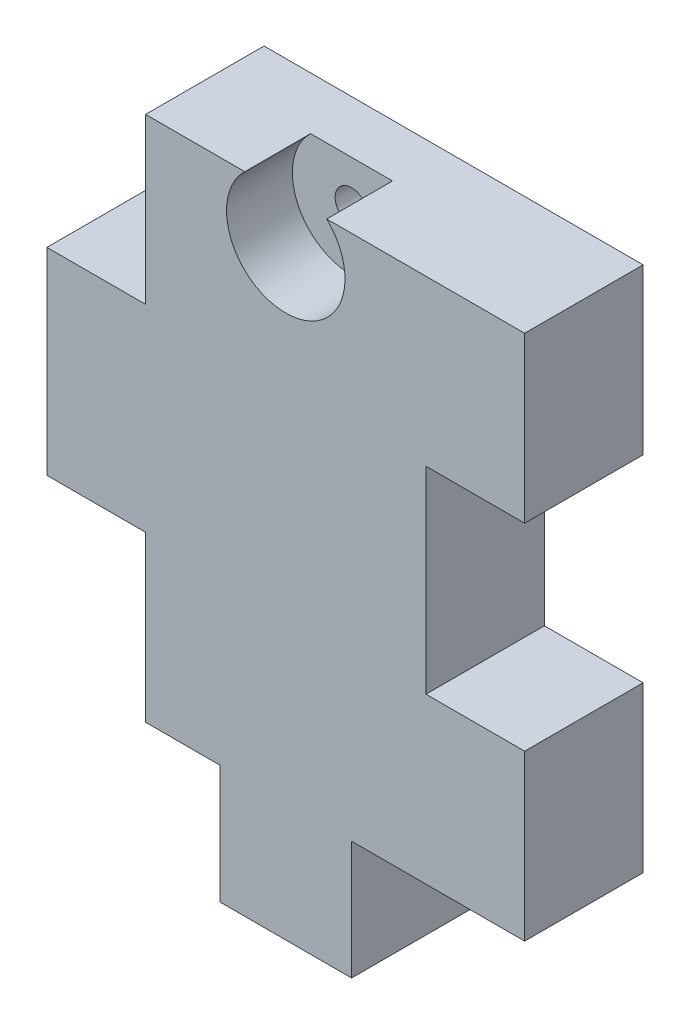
ISO-10303-21;
HEADER;
FILE_DESCRIPTION(('STEP AP214'),'2;1');
FILE_NAME('part.step','',(''),(''),'','','');
FILE_SCHEMA(('AUTOMOTIVE_DESIGN { 1 0 10303 214 1 1 1 1 }'));
ENDSEC;
DATA;
#1=APPLICATION_CONTEXT('core data for automotive mechanical design processes');
#2=APPLICATION_PROTOCOL_DEFINITION('international standard','automotive_design',2000,#1);
#3=PRODUCT_CONTEXT('',#1,'mechanical');
#4=PRODUCT('Part','Part','',(#3));
#5=PRODUCT_RELATED_PRODUCT_CATEGORY('part','',(#4));
#6=PRODUCT_DEFINITION_FORMATION('','',#4);
#7=PRODUCT_DEFINITION_CONTEXT('part definition',#1,'design');
#8=PRODUCT_DEFINITION('design','',#6,#7);
#9=PRODUCT_DEFINITION_SHAPE('','',#8);
#10=(LENGTH_UNIT() NAMED_UNIT(*) SI_UNIT(.MILLI.,.METRE.));
#11=(NAMED_UNIT(*) PLANE_ANGLE_UNIT() SI_UNIT($,.RADIAN.));
#12=(NAMED_UNIT(*) SI_UNIT($,.STERADIAN.) SOLID_ANGLE_UNIT());
#13=UNCERTAINTY_MEASURE_WITH_UNIT(LENGTH_MEASURE(1.E-05),#10,'distance_accuracy_value','');
#14=(GEOMETRIC_REPRESENTATION_CONTEXT(3) GLOBAL_UNCERTAINTY_ASSIGNED_CONTEXT((#13)) GLOBAL_UNIT_ASSIGNED_CONTEXT((#10,
#11,#12)) REPRESENTATION_CONTEXT('',''));
#15=CARTESIAN_POINT('',(0.,0.,0.));
#16=DIRECTION('',(0.,0.,1.));
#17=DIRECTION('',(1.,0.,0.));
#18=AXIS2_PLACEMENT_3D('',#15,#16,#17);
#19=CARTESIAN_POINT('',(21.3,-40.,18.));
#20=DIRECTION('',(0.,1.,0.));
#21=DIRECTION('',(0.,0.,1.));
#22=AXIS2_PLACEMENT_3D('',#19,#20,#21);
#23=PLANE('',#22);
#24=DIRECTION('',(1.,0.,0.));
#25=VECTOR('',#24,1.);
#26=CARTESIAN_POINT('',(21.3,-40.,0.));
#27=LINE('',#26,#25);
#28=CARTESIAN_POINT('',(-21.3,-40.,0.));
#29=VERTEX_POINT('',#28);
#30=CARTESIAN_POINT('',(-10.,-40.,0.));
#31=VERTEX_POINT('',#30);
#32=EDGE_CURVE('E246',#29,#31,#27,.T.);
#33=ORIENTED_EDGE('',*,*,#32,.T.);
#34=DIRECTION('',(0.,0.,1.));
#35=VECTOR('',#34,1.);
#36=CARTESIAN_POINT('',(-10.,-40.,18.));
#37=LINE('',#36,#35);
#38=CARTESIAN_POINT('',(-10.,-40.,18.));
#39=VERTEX_POINT('',#38);
#40=EDGE_CURVE('E167',#31,#39,#37,.T.);
#41=ORIENTED_EDGE('',*,*,#40,.T.);
#42=DIRECTION('',(1.,0.,0.));
#43=VECTOR('',#42,1.);
#44=CARTESIAN_POINT('',(-21.3,-40.,18.));
#45=LINE('',#44,#43);
#46=CARTESIAN_POINT('',(-21.3,-40.,18.));
#47=VERTEX_POINT('',#46);
#48=EDGE_CURVE('E219',#47,#39,#45,.T.);
#49=ORIENTED_EDGE('',*,*,#48,.F.);
#50=DIRECTION('',(0.,0.,-1.));
#51=VECTOR('',#50,1.);
#52=CARTESIAN_POINT('',(-21.3,-40.,18.));
#53=LINE('',#52,#51);
#54=EDGE_CURVE('E276',#47,#29,#53,.T.);
#55=ORIENTED_EDGE('',*,*,#54,.T.);
#56=EDGE_LOOP('',(#33,#41,#49,#55));
#57=FACE_BOUND('',#56,.T.);
#58=ADVANCED_FACE('F34',(#57),#23,.F.);
#59=CARTESIAN_POINT('',(-21.3,40.,18.));
#60=DIRECTION('',(0.,-1.,0.));
#61=DIRECTION('',(0.,0.,-1.));
#62=AXIS2_PLACEMENT_3D('',#59,#60,#61);
#63=PLANE('',#62);
#64=DIRECTION('',(-1.,0.,0.));
#65=VECTOR('',#64,1.);
#66=CARTESIAN_POINT('',(-21.3,40.,8.));
#67=LINE('',#66,#65);
#68=CARTESIAN_POINT('',(6.22494979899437,40.,8.));
#69=VERTEX_POINT('',#68);
#70=CARTESIAN_POINT('',(-6.22494979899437,40.,8.));
#71=VERTEX_POINT('',#70);
#72=EDGE_CURVE('E11',#69,#71,#67,.T.);
#73=ORIENTED_EDGE('',*,*,#72,.F.);
#74=DIRECTION('',(0.,0.,1.));
#75=VECTOR('',#74,1.);
#76=CARTESIAN_POINT('',(6.22494979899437,40.,8.));
#77=LINE('',#76,#75);
#78=CARTESIAN_POINT('',(6.22494979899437,40.,18.));
#79=VERTEX_POINT('',#78);
#80=EDGE_CURVE('E200',#69,#79,#77,.T.);
#81=ORIENTED_EDGE('',*,*,#80,.T.);
#82=DIRECTION('',(-1.,0.,0.));
#83=VECTOR('',#82,1.);
#84=CARTESIAN_POINT('',(21.3,40.,18.));
#85=LINE('',#84,#83);
#86=CARTESIAN_POINT('',(36.3,40.,18.));
#87=VERTEX_POINT('',#86);
#88=EDGE_CURVE('E204',#87,#79,#85,.T.);
#89=ORIENTED_EDGE('',*,*,#88,.F.);
#90=DIRECTION('',(0.,0.,-1.));
#91=VECTOR('',#90,1.);
#92=CARTESIAN_POINT('',(36.3,40.,18.));
#93=LINE('',#92,#91);
#94=CARTESIAN_POINT('',(36.3,40.,0.));
#95=VERTEX_POINT('',#94);
#96=EDGE_CURVE('E232',#87,#95,#93,.T.);
#97=ORIENTED_EDGE('',*,*,#96,.T.);
#98=DIRECTION('',(-1.,0.,0.));
#99=VECTOR('',#98,1.);
#100=CARTESIAN_POINT('',(-21.3,40.,0.));
#101=LINE('',#100,#99);
#102=CARTESIAN_POINT('',(-21.3,40.,0.));
#103=VERTEX_POINT('',#102);
#104=EDGE_CURVE('E203',#95,#103,#101,.T.);
#105=ORIENTED_EDGE('',*,*,#104,.T.);
#106=DIRECTION('',(0.,0.,-1.));
#107=VECTOR('',#106,1.);
#108=CARTESIAN_POINT('',(-21.3,40.,18.));
#109=LINE('',#108,#107);
#110=CARTESIAN_POINT('',(-21.3,40.,18.));
#111=VERTEX_POINT('',#110);
#112=EDGE_CURVE('E291',#111,#103,#109,.T.);
#113=ORIENTED_EDGE('',*,*,#112,.F.);
#114=CARTESIAN_POINT('',(-6.22494979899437,40.,18.));
#115=VERTEX_POINT('',#114);
#116=EDGE_CURVE('E208',#115,#111,#85,.T.);
#117=ORIENTED_EDGE('',*,*,#116,.F.);
#118=DIRECTION('',(0.,0.,1.));
#119=VECTOR('',#118,1.);
#120=CARTESIAN_POINT('',(-6.22494979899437,40.,8.));
#121=LINE('',#120,#119);
#122=EDGE_CURVE('E58',#115,#71,#121,.F.);
#123=ORIENTED_EDGE('',*,*,#122,.T.);
#124=EDGE_LOOP('',(#73,#81,#89,#97,#105,#113,#117,#123));
#125=FACE_BOUND('',#124,.T.);
#126=ADVANCED_FACE('F36',(#125),#63,.F.);
#127=CARTESIAN_POINT('',(-21.3,40.,18.));
#128=DIRECTION('',(1.,0.,0.));
#129=DIRECTION('',(0.,1.,0.));
#130=AXIS2_PLACEMENT_3D('',#127,#128,#129);
#131=PLANE('',#130);
#132=DIRECTION('',(0.,-1.,0.));
#133=VECTOR('',#132,1.);
#134=CARTESIAN_POINT('',(-21.3,40.,0.));
#135=LINE('',#134,#133);
#136=CARTESIAN_POINT('',(-21.3,15.,0.));
#137=VERTEX_POINT('',#136);
#138=EDGE_CURVE('E234',#103,#137,#135,.T.);
#139=ORIENTED_EDGE('',*,*,#138,.T.);
#140=DIRECTION('',(0.,0.,-1.));
#141=VECTOR('',#140,1.);
#142=CARTESIAN_POINT('',(-21.3,15.,18.));
#143=LINE('',#142,#141);
#144=CARTESIAN_POINT('',(-21.3,15.,18.));
#145=VERTEX_POINT('',#144);
#146=EDGE_CURVE('E288',#145,#137,#143,.T.);
#147=ORIENTED_EDGE('',*,*,#146,.F.);
#148=DIRECTION('',(0.,-1.,0.));
#149=VECTOR('',#148,1.);
#150=CARTESIAN_POINT('',(-21.3,40.,18.));
#151=LINE('',#150,#149);
#152=EDGE_CURVE('E207',#111,#145,#151,.T.);
#153=ORIENTED_EDGE('',*,*,#152,.F.);
#154=ORIENTED_EDGE('',*,*,#112,.T.);
#155=EDGE_LOOP('',(#139,#147,#153,#154));
#156=FACE_BOUND('',#155,.T.);
#157=ADVANCED_FACE('F304',(#156),#131,.F.);
#158=CARTESIAN_POINT('',(-36.3,15.,18.));
#159=DIRECTION('',(0.,-1.,0.));
#160=DIRECTION('',(0.,0.,-1.));
#161=AXIS2_PLACEMENT_3D('',#158,#159,#160);
#162=PLANE('',#161);
#163=DIRECTION('',(-1.,0.,0.));
#164=VECTOR('',#163,1.);
#165=CARTESIAN_POINT('',(-36.3,15.,0.));
#166=LINE('',#165,#164);
#167=CARTESIAN_POINT('',(-36.3,15.,0.));
#168=VERTEX_POINT('',#167);
#169=EDGE_CURVE('E236',#137,#168,#166,.T.);
#170=ORIENTED_EDGE('',*,*,#169,.T.);
#171=DIRECTION('',(0.,0.,-1.));
#172=VECTOR('',#171,1.);
#173=CARTESIAN_POINT('',(-36.3,15.,18.));
#174=LINE('',#173,#172);
#175=CARTESIAN_POINT('',(-36.3,15.,18.));
#176=VERTEX_POINT('',#175);
#177=EDGE_CURVE('E285',#176,#168,#174,.T.);
#178=ORIENTED_EDGE('',*,*,#177,.F.);
#179=DIRECTION('',(-1.,0.,0.));
#180=VECTOR('',#179,1.);
#181=CARTESIAN_POINT('',(-36.3,15.,18.));
#182=LINE('',#181,#180);
#183=EDGE_CURVE('E210',#145,#176,#182,.T.);
#184=ORIENTED_EDGE('',*,*,#183,.F.);
#185=ORIENTED_EDGE('',*,*,#146,.T.);
#186=EDGE_LOOP('',(#170,#178,#184,#185));
#187=FACE_BOUND('',#186,.T.);
#188=ADVANCED_FACE('F310',(#187),#162,.F.);
#189=CARTESIAN_POINT('',(-36.3,15.,18.));
#190=DIRECTION('',(1.,0.,0.));
#191=DIRECTION('',(0.,0.,-1.));
#192=AXIS2_PLACEMENT_3D('',#189,#190,#191);
#193=PLANE('',#192);
#194=DIRECTION('',(0.,-1.,0.));
#195=VECTOR('',#194,1.);
#196=CARTESIAN_POINT('',(-36.3,15.,0.));
#197=LINE('',#196,#195);
#198=CARTESIAN_POINT('',(-36.3,-15.,0.));
#199=VERTEX_POINT('',#198);
#200=EDGE_CURVE('E238',#168,#199,#197,.T.);
#201=ORIENTED_EDGE('',*,*,#200,.T.);
#202=DIRECTION('',(0.,0.,-1.));
#203=VECTOR('',#202,1.);
#204=CARTESIAN_POINT('',(-36.3,-15.,18.));
#205=LINE('',#204,#203);
#206=CARTESIAN_POINT('',(-36.3,-15.,18.));
#207=VERTEX_POINT('',#206);
#208=EDGE_CURVE('E282',#207,#199,#205,.T.);
#209=ORIENTED_EDGE('',*,*,#208,.F.);
#210=DIRECTION('',(0.,-1.,0.));
#211=VECTOR('',#210,1.);
#212=CARTESIAN_POINT('',(-36.3,15.,18.));
#213=LINE('',#212,#211);
#214=EDGE_CURVE('E212',#176,#207,#213,.T.);
#215=ORIENTED_EDGE('',*,*,#214,.F.);
#216=ORIENTED_EDGE('',*,*,#177,.T.);
#217=EDGE_LOOP('',(#201,#209,#215,#216));
#218=FACE_BOUND('',#217,.T.);
#219=ADVANCED_FACE('F314',(#218),#193,.F.);
#220=CARTESIAN_POINT('',(-21.3,-15.,18.));
#221=DIRECTION('',(0.,1.,0.));
#222=DIRECTION('',(0.,0.,1.));
#223=AXIS2_PLACEMENT_3D('',#220,#221,#222);
#224=PLANE('',#223);
#225=DIRECTION('',(1.,0.,0.));
#226=VECTOR('',#225,1.);
#227=CARTESIAN_POINT('',(-21.3,-15.,0.));
#228=LINE('',#227,#226);
#229=CARTESIAN_POINT('',(-21.3,-15.,0.));
#230=VERTEX_POINT('',#229);
#231=EDGE_CURVE('E240',#199,#230,#228,.T.);
#232=ORIENTED_EDGE('',*,*,#231,.T.);
#233=DIRECTION('',(0.,0.,-1.));
#234=VECTOR('',#233,1.);
#235=CARTESIAN_POINT('',(-21.3,-15.,18.));
#236=LINE('',#235,#234);
#237=CARTESIAN_POINT('',(-21.3,-15.,18.));
#238=VERTEX_POINT('',#237);
#239=EDGE_CURVE('E279',#238,#230,#236,.T.);
#240=ORIENTED_EDGE('',*,*,#239,.F.);
#241=DIRECTION('',(1.,0.,0.));
#242=VECTOR('',#241,1.);
#243=CARTESIAN_POINT('',(-21.3,-15.,18.));
#244=LINE('',#243,#242);
#245=EDGE_CURVE('E214',#207,#238,#244,.T.);
#246=ORIENTED_EDGE('',*,*,#245,.F.);
#247=ORIENTED_EDGE('',*,*,#208,.T.);
#248=EDGE_LOOP('',(#232,#240,#246,#247));
#249=FACE_BOUND('',#248,.T.);
#250=ADVANCED_FACE('F319',(#249),#224,.F.);
#251=CARTESIAN_POINT('',(-21.3,-15.,18.));
#252=DIRECTION('',(1.,0.,0.));
#253=DIRECTION('',(0.,1.,0.));
#254=AXIS2_PLACEMENT_3D('',#251,#252,#253);
#255=PLANE('',#254);
#256=DIRECTION('',(0.,-1.,0.));
#257=VECTOR('',#256,1.);
#258=CARTESIAN_POINT('',(-21.3,-15.,0.));
#259=LINE('',#258,#257);
#260=EDGE_CURVE('E242',#230,#29,#259,.T.);
#261=ORIENTED_EDGE('',*,*,#260,.T.);
#262=ORIENTED_EDGE('',*,*,#54,.F.);
#263=DIRECTION('',(0.,-1.,0.));
#264=VECTOR('',#263,1.);
#265=CARTESIAN_POINT('',(-21.3,-15.,18.));
#266=LINE('',#265,#264);
#267=EDGE_CURVE('E216',#238,#47,#266,.T.);
#268=ORIENTED_EDGE('',*,*,#267,.F.);
#269=ORIENTED_EDGE('',*,*,#239,.T.);
#270=EDGE_LOOP('',(#261,#262,#268,#269));
#271=FACE_BOUND('',#270,.T.);
#272=ADVANCED_FACE('F324',(#271),#255,.F.);
#273=CARTESIAN_POINT('',(10.,-40.,18.));
#274=VERTEX_POINT('',#273);
#275=CARTESIAN_POINT('',(36.3,-40.,18.));
#276=VERTEX_POINT('',#275);
#277=EDGE_CURVE('E218',#274,#276,#45,.T.);
#278=ORIENTED_EDGE('',*,*,#277,.F.);
#279=DIRECTION('',(0.,0.,-1.));
#280=VECTOR('',#279,1.);
#281=CARTESIAN_POINT('',(10.,-40.,18.));
#282=LINE('',#281,#280);
#283=CARTESIAN_POINT('',(10.,-40.,0.));
#284=VERTEX_POINT('',#283);
#285=EDGE_CURVE('E191',#274,#284,#282,.T.);
#286=ORIENTED_EDGE('',*,*,#285,.T.);
#287=CARTESIAN_POINT('',(36.3,-40.,0.));
#288=VERTEX_POINT('',#287);
#289=EDGE_CURVE('E245',#284,#288,#27,.T.);
#290=ORIENTED_EDGE('',*,*,#289,.T.);
#291=DIRECTION('',(0.,0.,-1.));
#292=VECTOR('',#291,1.);
#293=CARTESIAN_POINT('',(36.3,-40.,18.));
#294=LINE('',#293,#292);
#295=EDGE_CURVE('E273',#276,#288,#294,.T.);
#296=ORIENTED_EDGE('',*,*,#295,.F.);
#297=EDGE_LOOP('',(#278,#286,#290,#296));
#298=FACE_BOUND('',#297,.T.);
#299=ADVANCED_FACE('F351',(#298),#23,.F.);
#300=CARTESIAN_POINT('',(36.3,-15.,18.));
#301=DIRECTION('',(-1.,0.,0.));
#302=DIRECTION('',(0.,-1.,0.));
#303=AXIS2_PLACEMENT_3D('',#300,#301,#302);
#304=PLANE('',#303);
#305=DIRECTION('',(0.,1.,0.));
#306=VECTOR('',#305,1.);
#307=CARTESIAN_POINT('',(36.3,-15.,0.));
#308=LINE('',#307,#306);
#309=CARTESIAN_POINT('',(36.3,-15.,0.));
#310=VERTEX_POINT('',#309);
#311=EDGE_CURVE('E248',#288,#310,#308,.T.);
#312=ORIENTED_EDGE('',*,*,#311,.T.);
#313=DIRECTION('',(0.,0.,-1.));
#314=VECTOR('',#313,1.);
#315=CARTESIAN_POINT('',(36.3,-15.,18.));
#316=LINE('',#315,#314);
#317=CARTESIAN_POINT('',(36.3,-15.,18.));
#318=VERTEX_POINT('',#317);
#319=EDGE_CURVE('E270',#318,#310,#316,.T.);
#320=ORIENTED_EDGE('',*,*,#319,.F.);
#321=DIRECTION('',(0.,1.,0.));
#322=VECTOR('',#321,1.);
#323=CARTESIAN_POINT('',(36.3,-15.,18.));
#324=LINE('',#323,#322);
#325=EDGE_CURVE('E222',#276,#318,#324,.T.);
#326=ORIENTED_EDGE('',*,*,#325,.F.);
#327=ORIENTED_EDGE('',*,*,#295,.T.);
#328=EDGE_LOOP('',(#312,#320,#326,#327));
#329=FACE_BOUND('',#328,.T.);
#330=ADVANCED_FACE('F358',(#329),#304,.F.);
#331=CARTESIAN_POINT('',(21.3,-15.,18.));
#332=DIRECTION('',(0.,-1.,0.));
#333=DIRECTION('',(0.,0.,-1.));
#334=AXIS2_PLACEMENT_3D('',#331,#332,#333);
#335=PLANE('',#334);
#336=DIRECTION('',(-1.,0.,0.));
#337=VECTOR('',#336,1.);
#338=CARTESIAN_POINT('',(21.3,-15.,0.));
#339=LINE('',#338,#337);
#340=CARTESIAN_POINT('',(21.3,-15.,0.));
#341=VERTEX_POINT('',#340);
#342=EDGE_CURVE('E250',#310,#341,#339,.T.);
#343=ORIENTED_EDGE('',*,*,#342,.T.);
#344=DIRECTION('',(0.,0.,-1.));
#345=VECTOR('',#344,1.);
#346=CARTESIAN_POINT('',(21.3,-15.,18.));
#347=LINE('',#346,#345);
#348=CARTESIAN_POINT('',(21.3,-15.,18.));
#349=VERTEX_POINT('',#348);
#350=EDGE_CURVE('E267',#349,#341,#347,.T.);
#351=ORIENTED_EDGE('',*,*,#350,.F.);
#352=DIRECTION('',(-1.,0.,0.));
#353=VECTOR('',#352,1.);
#354=CARTESIAN_POINT('',(21.3,-15.,18.));
#355=LINE('',#354,#353);
#356=EDGE_CURVE('E224',#318,#349,#355,.T.);
#357=ORIENTED_EDGE('',*,*,#356,.F.);
#358=ORIENTED_EDGE('',*,*,#319,.T.);
#359=EDGE_LOOP('',(#343,#351,#357,#358));
#360=FACE_BOUND('',#359,.T.);
#361=ADVANCED_FACE('F364',(#360),#335,.F.);
#362=CARTESIAN_POINT('',(21.3,15.,18.));
#363=DIRECTION('',(-1.,0.,0.));
#364=DIRECTION('',(0.,-1.,0.));
#365=AXIS2_PLACEMENT_3D('',#362,#363,#364);
#366=PLANE('',#365);
#367=DIRECTION('',(0.,1.,0.));
#368=VECTOR('',#367,1.);
#369=CARTESIAN_POINT('',(21.3,15.,0.));
#370=LINE('',#369,#368);
#371=CARTESIAN_POINT('',(21.3,15.,0.));
#372=VERTEX_POINT('',#371);
#373=EDGE_CURVE('E252',#341,#372,#370,.T.);
#374=ORIENTED_EDGE('',*,*,#373,.T.);
#375=DIRECTION('',(0.,0.,-1.));
#376=VECTOR('',#375,1.);
#377=CARTESIAN_POINT('',(21.3,15.,18.));
#378=LINE('',#377,#376);
#379=CARTESIAN_POINT('',(21.3,15.,18.));
#380=VERTEX_POINT('',#379);
#381=EDGE_CURVE('E264',#380,#372,#378,.T.);
#382=ORIENTED_EDGE('',*,*,#381,.F.);
#383=DIRECTION('',(0.,1.,0.));
#384=VECTOR('',#383,1.);
#385=CARTESIAN_POINT('',(21.3,15.,18.));
#386=LINE('',#385,#384);
#387=EDGE_CURVE('E226',#349,#380,#386,.T.);
#388=ORIENTED_EDGE('',*,*,#387,.F.);
#389=ORIENTED_EDGE('',*,*,#350,.T.);
#390=EDGE_LOOP('',(#374,#382,#388,#389));
#391=FACE_BOUND('',#390,.T.);
#392=ADVANCED_FACE('F379',(#391),#366,.F.);
#393=CARTESIAN_POINT('',(21.3,15.,18.));
#394=DIRECTION('',(0.,1.,0.));
#395=DIRECTION('',(0.,0.,1.));
#396=AXIS2_PLACEMENT_3D('',#393,#394,#395);
#397=PLANE('',#396);
#398=DIRECTION('',(1.,0.,0.));
#399=VECTOR('',#398,1.);
#400=CARTESIAN_POINT('',(21.3,15.,0.));
#401=LINE('',#400,#399);
#402=CARTESIAN_POINT('',(36.3,15.,0.));
#403=VERTEX_POINT('',#402);
#404=EDGE_CURVE('E254',#372,#403,#401,.T.);
#405=ORIENTED_EDGE('',*,*,#404,.T.);
#406=DIRECTION('',(0.,0.,-1.));
#407=VECTOR('',#406,1.);
#408=CARTESIAN_POINT('',(36.3,15.,18.));
#409=LINE('',#408,#407);
#410=CARTESIAN_POINT('',(36.3,15.,18.));
#411=VERTEX_POINT('',#410);
#412=EDGE_CURVE('E261',#411,#403,#409,.T.);
#413=ORIENTED_EDGE('',*,*,#412,.F.);
#414=DIRECTION('',(1.,0.,0.));
#415=VECTOR('',#414,1.);
#416=CARTESIAN_POINT('',(21.3,15.,18.));
#417=LINE('',#416,#415);
#418=EDGE_CURVE('E228',#380,#411,#417,.T.);
#419=ORIENTED_EDGE('',*,*,#418,.F.);
#420=ORIENTED_EDGE('',*,*,#381,.T.);
#421=EDGE_LOOP('',(#405,#413,#419,#420));
#422=FACE_BOUND('',#421,.T.);
#423=ADVANCED_FACE('F382',(#422),#397,.F.);
#424=CARTESIAN_POINT('',(36.3,40.,18.));
#425=DIRECTION('',(-1.,0.,0.));
#426=DIRECTION('',(0.,0.,1.));
#427=AXIS2_PLACEMENT_3D('',#424,#425,#426);
#428=PLANE('',#427);
#429=DIRECTION('',(0.,1.,0.));
#430=VECTOR('',#429,1.);
#431=CARTESIAN_POINT('',(36.3,40.,0.));
#432=LINE('',#431,#430);
#433=EDGE_CURVE('E256',#403,#95,#432,.T.);
#434=ORIENTED_EDGE('',*,*,#433,.T.);
#435=ORIENTED_EDGE('',*,*,#96,.F.);
#436=DIRECTION('',(0.,1.,0.));
#437=VECTOR('',#436,1.);
#438=CARTESIAN_POINT('',(36.3,40.,18.));
#439=LINE('',#438,#437);
#440=EDGE_CURVE('E230',#411,#87,#439,.T.);
#441=ORIENTED_EDGE('',*,*,#440,.F.);
#442=ORIENTED_EDGE('',*,*,#412,.T.);
#443=EDGE_LOOP('',(#434,#435,#441,#442));
#444=FACE_BOUND('',#443,.T.);
#445=ADVANCED_FACE('F331',(#444),#428,.F.);
#446=CARTESIAN_POINT('',(0.,0.,18.));
#447=DIRECTION('',(0.,0.,-1.));
#448=DIRECTION('',(-1.,0.,0.));
#449=AXIS2_PLACEMENT_3D('',#446,#447,#448);
#450=PLANE('',#449);
#451=ORIENTED_EDGE('',*,*,#48,.T.);
#452=DIRECTION('',(0.,-1.,0.));
#453=VECTOR('',#452,1.);
#454=CARTESIAN_POINT('',(-10.,-58.,18.));
#455=LINE('',#454,#453);
#456=CARTESIAN_POINT('',(-10.,-58.,18.));
#457=VERTEX_POINT('',#456);
#458=EDGE_CURVE('E187',#39,#457,#455,.T.);
#459=ORIENTED_EDGE('',*,*,#458,.T.);
#460=DIRECTION('',(1.,0.,0.));
#461=VECTOR('',#460,1.);
#462=CARTESIAN_POINT('',(-10.,-58.,18.));
#463=LINE('',#462,#461);
#464=CARTESIAN_POINT('',(10.,-58.,18.));
#465=VERTEX_POINT('',#464);
#466=EDGE_CURVE('E176',#457,#465,#463,.T.);
#467=ORIENTED_EDGE('',*,*,#466,.T.);
#468=DIRECTION('',(0.,1.,0.));
#469=VECTOR('',#468,1.);
#470=CARTESIAN_POINT('',(10.,-58.,18.));
#471=LINE('',#470,#469);
#472=EDGE_CURVE('E50',#465,#274,#471,.T.);
#473=ORIENTED_EDGE('',*,*,#472,.T.);
#474=ORIENTED_EDGE('',*,*,#277,.T.);
#475=ORIENTED_EDGE('',*,*,#325,.T.);
#476=ORIENTED_EDGE('',*,*,#356,.T.);
#477=ORIENTED_EDGE('',*,*,#387,.T.);
#478=ORIENTED_EDGE('',*,*,#418,.T.);
#479=ORIENTED_EDGE('',*,*,#440,.T.);
#480=ORIENTED_EDGE('',*,*,#88,.T.);
#481=CARTESIAN_POINT('',(0.,33.5,18.));
#482=DIRECTION('',(0.,0.,-1.));
#483=DIRECTION('',(-1.,0.,0.));
#484=AXIS2_PLACEMENT_3D('',#481,#482,#483);
#485=CIRCLE('',#484,9.);
#486=EDGE_CURVE('E43',#79,#115,#485,.T.);
#487=ORIENTED_EDGE('',*,*,#486,.T.);
#488=ORIENTED_EDGE('',*,*,#116,.T.);
#489=ORIENTED_EDGE('',*,*,#152,.T.);
#490=ORIENTED_EDGE('',*,*,#183,.T.);
#491=ORIENTED_EDGE('',*,*,#214,.T.);
#492=ORIENTED_EDGE('',*,*,#245,.T.);
#493=ORIENTED_EDGE('',*,*,#267,.T.);
#494=EDGE_LOOP('',(#451,#459,#467,#473,#474,#475,#476,#477,#478,#479,#480,#487,#488,#489,#490,
#491,#492,#493));
#495=FACE_BOUND('',#494,.T.);
#496=ADVANCED_FACE('F295',(#495),#450,.F.);
#497=CARTESIAN_POINT('',(0.,0.,0.));
#498=DIRECTION('',(0.,0.,-1.));
#499=DIRECTION('',(-1.,0.,0.));
#500=AXIS2_PLACEMENT_3D('',#497,#498,#499);
#501=PLANE('',#500);
#502=CARTESIAN_POINT('',(0.,33.5,0.));
#503=DIRECTION('',(0.,0.,1.));
#504=DIRECTION('',(1.,0.,0.));
#505=AXIS2_PLACEMENT_3D('',#502,#503,#504);
#506=CIRCLE('',#505,2.5);
#507=CARTESIAN_POINT('',(2.5,33.5,0.));
#508=VERTEX_POINT('',#507);
#509=EDGE_CURVE('E500',#508,#508,#506,.T.);
#510=ORIENTED_EDGE('',*,*,#509,.T.);
#511=EDGE_LOOP('',(#510));
#512=FACE_BOUND('',#511,.T.);
#513=ORIENTED_EDGE('',*,*,#289,.F.);
#514=DIRECTION('',(0.,1.,0.));
#515=VECTOR('',#514,1.);
#516=CARTESIAN_POINT('',(10.,-58.,0.));
#517=LINE('',#516,#515);
#518=CARTESIAN_POINT('',(10.,-58.,0.));
#519=VERTEX_POINT('',#518);
#520=EDGE_CURVE('E178',#519,#284,#517,.T.);
#521=ORIENTED_EDGE('',*,*,#520,.F.);
#522=DIRECTION('',(1.,0.,0.));
#523=VECTOR('',#522,1.);
#524=CARTESIAN_POINT('',(-10.,-58.,0.));
#525=LINE('',#524,#523);
#526=CARTESIAN_POINT('',(-10.,-58.,0.));
#527=VERTEX_POINT('',#526);
#528=EDGE_CURVE('E171',#527,#519,#525,.T.);
#529=ORIENTED_EDGE('',*,*,#528,.F.);
#530=DIRECTION('',(0.,-1.,0.));
#531=VECTOR('',#530,1.);
#532=CARTESIAN_POINT('',(-10.,-58.,0.));
#533=LINE('',#532,#531);
#534=EDGE_CURVE('E161',#31,#527,#533,.T.);
#535=ORIENTED_EDGE('',*,*,#534,.F.);
#536=ORIENTED_EDGE('',*,*,#32,.F.);
#537=ORIENTED_EDGE('',*,*,#260,.F.);
#538=ORIENTED_EDGE('',*,*,#231,.F.);
#539=ORIENTED_EDGE('',*,*,#200,.F.);
#540=ORIENTED_EDGE('',*,*,#169,.F.);
#541=ORIENTED_EDGE('',*,*,#138,.F.);
#542=ORIENTED_EDGE('',*,*,#104,.F.);
#543=ORIENTED_EDGE('',*,*,#433,.F.);
#544=ORIENTED_EDGE('',*,*,#404,.F.);
#545=ORIENTED_EDGE('',*,*,#373,.F.);
#546=ORIENTED_EDGE('',*,*,#342,.F.);
#547=ORIENTED_EDGE('',*,*,#311,.F.);
#548=EDGE_LOOP('',(#513,#521,#529,#535,#536,#537,#538,#539,#540,#541,#542,#543,#544,#545,#546,#547));
#549=FACE_BOUND('',#548,.T.);
#550=ADVANCED_FACE('F182',(#512,#549),#501,.T.);
#551=CARTESIAN_POINT('',(0.,33.5,8.));
#552=DIRECTION('',(0.,0.,1.));
#553=DIRECTION('',(1.,0.,0.));
#554=AXIS2_PLACEMENT_3D('',#551,#552,#553);
#555=PLANE('',#554);
#556=CARTESIAN_POINT('',(0.,33.5,8.));
#557=DIRECTION('',(0.,0.,1.));
#558=DIRECTION('',(1.,0.,0.));
#559=AXIS2_PLACEMENT_3D('',#556,#557,#558);
#560=CIRCLE('',#559,2.5);
#561=CARTESIAN_POINT('',(2.5,33.5,8.));
#562=VERTEX_POINT('',#561);
#563=EDGE_CURVE('E38',#562,#562,#560,.T.);
#564=ORIENTED_EDGE('',*,*,#563,.F.);
#565=EDGE_LOOP('',(#564));
#566=FACE_BOUND('',#565,.T.);
#567=ORIENTED_EDGE('',*,*,#72,.T.);
#568=CARTESIAN_POINT('',(0.,33.5,8.));
#569=DIRECTION('',(0.,0.,1.));
#570=DIRECTION('',(1.,0.,0.));
#571=AXIS2_PLACEMENT_3D('',#568,#569,#570);
#572=CIRCLE('',#571,9.);
#573=EDGE_CURVE('E196',#71,#69,#572,.T.);
#574=ORIENTED_EDGE('',*,*,#573,.T.);
#575=EDGE_LOOP('',(#567,#574));
#576=FACE_BOUND('',#575,.T.);
#577=ADVANCED_FACE('F336',(#566,#576),#555,.T.);
#578=CARTESIAN_POINT('',(0.,33.5,8.));
#579=DIRECTION('',(0.,0.,1.));
#580=DIRECTION('',(1.,0.,0.));
#581=AXIS2_PLACEMENT_3D('',#578,#579,#580);
#582=CYLINDRICAL_SURFACE('',#581,9.);
#583=ORIENTED_EDGE('',*,*,#573,.F.);
#584=ORIENTED_EDGE('',*,*,#122,.F.);
#585=ORIENTED_EDGE('',*,*,#486,.F.);
#586=ORIENTED_EDGE('',*,*,#80,.F.);
#587=EDGE_LOOP('',(#583,#584,#585,#586));
#588=FACE_BOUND('',#587,.T.);
#589=ADVANCED_FACE('F334',(#588),#582,.F.);
#590=CARTESIAN_POINT('',(-10.,-58.,0.));
#591=DIRECTION('',(-1.,0.,0.));
#592=DIRECTION('',(0.,-1.,0.));
#593=AXIS2_PLACEMENT_3D('',#590,#591,#592);
#594=PLANE('',#593);
#595=ORIENTED_EDGE('',*,*,#40,.F.);
#596=ORIENTED_EDGE('',*,*,#534,.T.);
#597=DIRECTION('',(0.,0.,1.));
#598=VECTOR('',#597,1.);
#599=CARTESIAN_POINT('',(-10.,-58.,0.));
#600=LINE('',#599,#598);
#601=EDGE_CURVE('E164',#527,#457,#600,.T.);
#602=ORIENTED_EDGE('',*,*,#601,.T.);
#603=ORIENTED_EDGE('',*,*,#458,.F.);
#604=EDGE_LOOP('',(#595,#596,#602,#603));
#605=FACE_BOUND('',#604,.T.);
#606=ADVANCED_FACE('F163',(#605),#594,.T.);
#607=CARTESIAN_POINT('',(10.,-58.,0.));
#608=DIRECTION('',(1.,0.,0.));
#609=DIRECTION('',(0.,1.,0.));
#610=AXIS2_PLACEMENT_3D('',#607,#608,#609);
#611=PLANE('',#610);
#612=ORIENTED_EDGE('',*,*,#285,.F.);
#613=ORIENTED_EDGE('',*,*,#472,.F.);
#614=DIRECTION('',(0.,0.,1.));
#615=VECTOR('',#614,1.);
#616=CARTESIAN_POINT('',(10.,-58.,0.));
#617=LINE('',#616,#615);
#618=EDGE_CURVE('E177',#519,#465,#617,.T.);
#619=ORIENTED_EDGE('',*,*,#618,.F.);
#620=ORIENTED_EDGE('',*,*,#520,.T.);
#621=EDGE_LOOP('',(#612,#613,#619,#620));
#622=FACE_BOUND('',#621,.T.);
#623=ADVANCED_FACE('F457',(#622),#611,.T.);
#624=CARTESIAN_POINT('',(-10.,-58.,0.));
#625=DIRECTION('',(0.,-1.,0.));
#626=DIRECTION('',(0.,0.,-1.));
#627=AXIS2_PLACEMENT_3D('',#624,#625,#626);
#628=PLANE('',#627);
#629=ORIENTED_EDGE('',*,*,#466,.F.);
#630=ORIENTED_EDGE('',*,*,#601,.F.);
#631=ORIENTED_EDGE('',*,*,#528,.T.);
#632=ORIENTED_EDGE('',*,*,#618,.T.);
#633=EDGE_LOOP('',(#629,#630,#631,#632));
#634=FACE_BOUND('',#633,.T.);
#635=ADVANCED_FACE('F175',(#634),#628,.T.);
#636=CARTESIAN_POINT('',(0.,33.5,0.));
#637=DIRECTION('',(0.,0.,1.));
#638=DIRECTION('',(1.,0.,0.));
#639=AXIS2_PLACEMENT_3D('',#636,#637,#638);
#640=CYLINDRICAL_SURFACE('',#639,2.5);
#641=ORIENTED_EDGE('',*,*,#563,.T.);
#642=EDGE_LOOP('',(#641));
#643=FACE_BOUND('',#642,.T.);
#644=ORIENTED_EDGE('',*,*,#509,.F.);
#645=EDGE_LOOP('',(#644));
#646=FACE_BOUND('',#645,.T.);
#647=ADVANCED_FACE('F474',(#643,#646),#640,.F.);
#648=CLOSED_SHELL('',(#58,#126,#157,#188,#219,#250,#272,#299,#330,#361,#392,#423,#445,#496,#550,
#577,#589,#606,#623,#635,#647));
#649=MANIFOLD_SOLID_BREP('B2',#648);
#650=ADVANCED_BREP_SHAPE_REPRESENTATION('',(#18,#649),#14);
#651=SHAPE_DEFINITION_REPRESENTATION(#9,#650);
ENDSEC;
END-ISO-10303-21;
